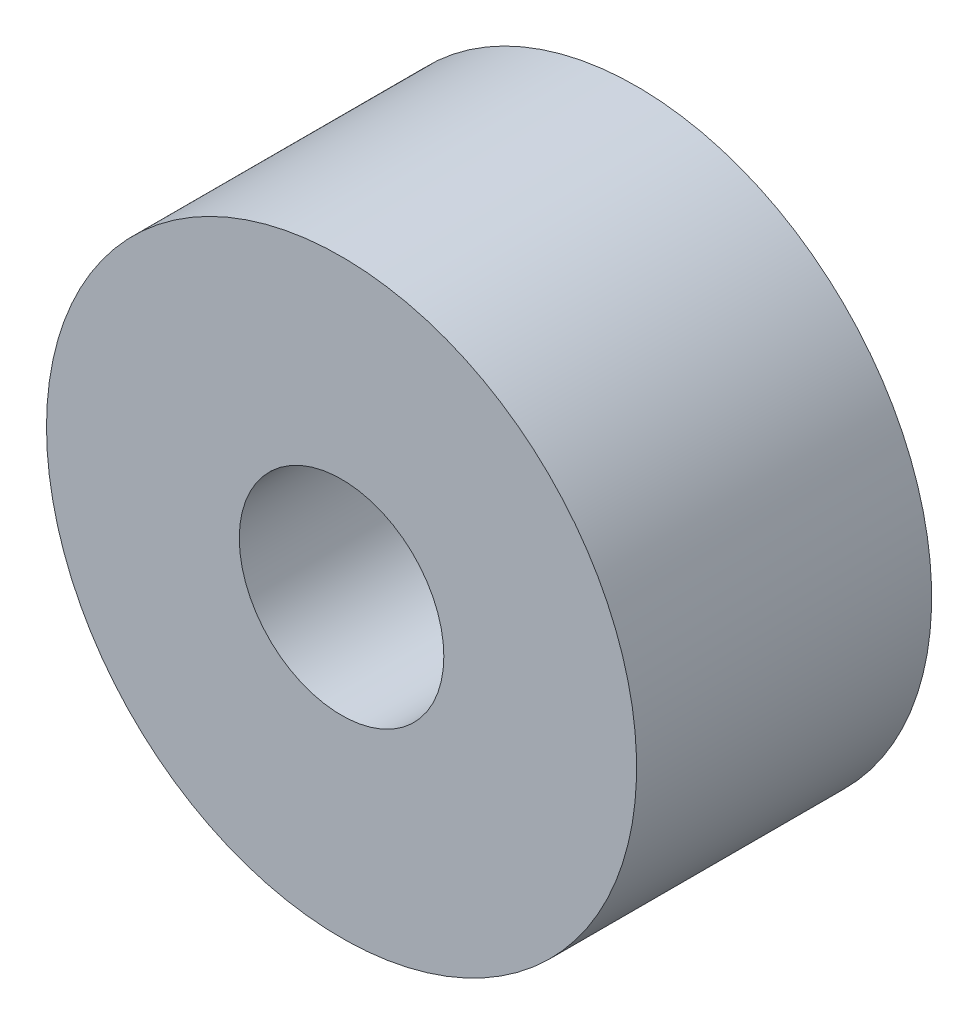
ISO-10303-21;
HEADER;
FILE_DESCRIPTION(('STEP AP214'),'2;1');
FILE_NAME('part.step','',(''),(''),'','','');
FILE_SCHEMA(('AUTOMOTIVE_DESIGN { 1 0 10303 214 1 1 1 1 }'));
ENDSEC;
DATA;
#1=APPLICATION_CONTEXT('core data for automotive mechanical design processes');
#2=APPLICATION_PROTOCOL_DEFINITION('international standard','automotive_design',2000,#1);
#3=PRODUCT_CONTEXT('',#1,'mechanical');
#4=PRODUCT('Part','Part','',(#3));
#5=PRODUCT_RELATED_PRODUCT_CATEGORY('part','',(#4));
#6=PRODUCT_DEFINITION_FORMATION('','',#4);
#7=PRODUCT_DEFINITION_CONTEXT('part definition',#1,'design');
#8=PRODUCT_DEFINITION('design','',#6,#7);
#9=PRODUCT_DEFINITION_SHAPE('','',#8);
#10=(LENGTH_UNIT() NAMED_UNIT(*) SI_UNIT(.MILLI.,.METRE.));
#11=(NAMED_UNIT(*) PLANE_ANGLE_UNIT() SI_UNIT($,.RADIAN.));
#12=(NAMED_UNIT(*) SI_UNIT($,.STERADIAN.) SOLID_ANGLE_UNIT());
#13=UNCERTAINTY_MEASURE_WITH_UNIT(LENGTH_MEASURE(1.E-05),#10,'distance_accuracy_value','');
#14=(GEOMETRIC_REPRESENTATION_CONTEXT(3) GLOBAL_UNCERTAINTY_ASSIGNED_CONTEXT((#13)) GLOBAL_UNIT_ASSIGNED_CONTEXT((#10,
#11,#12)) REPRESENTATION_CONTEXT('',''));
#15=CARTESIAN_POINT('',(0.,0.,0.));
#16=DIRECTION('',(0.,0.,1.));
#17=DIRECTION('',(1.,0.,0.));
#18=AXIS2_PLACEMENT_3D('',#15,#16,#17);
#19=CARTESIAN_POINT('',(0.,0.,9.525));
#20=DIRECTION('',(0.,0.,1.));
#21=DIRECTION('',(1.,0.,0.));
#22=AXIS2_PLACEMENT_3D('',#19,#20,#21);
#23=PLANE('',#22);
#24=CARTESIAN_POINT('',(0.,0.,9.525));
#25=DIRECTION('',(0.,0.,1.));
#26=DIRECTION('',(1.,0.,0.));
#27=AXIS2_PLACEMENT_3D('',#24,#25,#26);
#28=CIRCLE('',#27,9.525);
#29=CARTESIAN_POINT('',(-9.525,0.,9.525));
#30=VERTEX_POINT('',#29);
#31=EDGE_CURVE('E10',#30,#30,#28,.T.);
#32=ORIENTED_EDGE('',*,*,#31,.T.);
#33=EDGE_LOOP('',(#32));
#34=FACE_BOUND('',#33,.T.);
#35=CARTESIAN_POINT('',(0.,0.,9.525));
#36=DIRECTION('',(0.,0.,1.));
#37=DIRECTION('',(1.,0.,0.));
#38=AXIS2_PLACEMENT_3D('',#35,#36,#37);
#39=CIRCLE('',#38,3.302);
#40=CARTESIAN_POINT('',(-3.302,0.,9.525));
#41=VERTEX_POINT('',#40);
#42=EDGE_CURVE('E40',#41,#41,#39,.T.);
#43=ORIENTED_EDGE('',*,*,#42,.F.);
#44=EDGE_LOOP('',(#43));
#45=FACE_BOUND('',#44,.T.);
#46=ADVANCED_FACE('F29',(#34,#45),#23,.T.);
#47=CARTESIAN_POINT('',(0.,0.,0.));
#48=DIRECTION('',(0.,0.,1.));
#49=DIRECTION('',(1.,0.,0.));
#50=AXIS2_PLACEMENT_3D('',#47,#48,#49);
#51=PLANE('',#50);
#52=CARTESIAN_POINT('',(0.,0.,0.));
#53=DIRECTION('',(0.,0.,1.));
#54=DIRECTION('',(1.,0.,0.));
#55=AXIS2_PLACEMENT_3D('',#52,#53,#54);
#56=CIRCLE('',#55,9.525);
#57=CARTESIAN_POINT('',(-9.525,0.,0.));
#58=VERTEX_POINT('',#57);
#59=EDGE_CURVE('E36',#58,#58,#56,.T.);
#60=ORIENTED_EDGE('',*,*,#59,.F.);
#61=EDGE_LOOP('',(#60));
#62=FACE_BOUND('',#61,.T.);
#63=CARTESIAN_POINT('',(0.,0.,0.));
#64=DIRECTION('',(0.,0.,1.));
#65=DIRECTION('',(1.,0.,0.));
#66=AXIS2_PLACEMENT_3D('',#63,#64,#65);
#67=CIRCLE('',#66,3.302);
#68=CARTESIAN_POINT('',(-3.302,0.,0.));
#69=VERTEX_POINT('',#68);
#70=EDGE_CURVE('E44',#69,#69,#67,.T.);
#71=ORIENTED_EDGE('',*,*,#70,.T.);
#72=EDGE_LOOP('',(#71));
#73=FACE_BOUND('',#72,.T.);
#74=ADVANCED_FACE('F50',(#62,#73),#51,.F.);
#75=CARTESIAN_POINT('',(0.,0.,9.525));
#76=DIRECTION('',(0.,0.,-1.));
#77=DIRECTION('',(-1.,0.,0.));
#78=AXIS2_PLACEMENT_3D('',#75,#76,#77);
#79=CYLINDRICAL_SURFACE('',#78,9.525);
#80=CARTESIAN_POINT('',(-9.525,0.,9.525));
#81=CARTESIAN_POINT('',(-9.525,0.,9.42578125));
#82=CARTESIAN_POINT('',(-9.525,0.,9.3265625));
#83=CARTESIAN_POINT('',(-9.525,0.,9.128125));
#84=CARTESIAN_POINT('',(-9.525,0.,9.02890625));
#85=CARTESIAN_POINT('',(-9.525,0.,8.83046875));
#86=CARTESIAN_POINT('',(-9.525,0.,8.73125));
#87=CARTESIAN_POINT('',(-9.525,0.,8.5328125));
#88=CARTESIAN_POINT('',(-9.525,0.,8.43359375));
#89=CARTESIAN_POINT('',(-9.525,0.,8.23515625));
#90=CARTESIAN_POINT('',(-9.525,0.,8.1359375));
#91=CARTESIAN_POINT('',(-9.525,0.,7.9375));
#92=CARTESIAN_POINT('',(-9.525,0.,7.83828125));
#93=CARTESIAN_POINT('',(-9.525,0.,7.63984375));
#94=CARTESIAN_POINT('',(-9.525,0.,7.540625));
#95=CARTESIAN_POINT('',(-9.525,0.,7.3421875));
#96=CARTESIAN_POINT('',(-9.525,0.,7.24296875));
#97=CARTESIAN_POINT('',(-9.525,0.,7.04453125));
#98=CARTESIAN_POINT('',(-9.525,0.,6.9453125));
#99=CARTESIAN_POINT('',(-9.525,0.,6.746875));
#100=CARTESIAN_POINT('',(-9.525,0.,6.64765625));
#101=CARTESIAN_POINT('',(-9.525,0.,6.44921875));
#102=CARTESIAN_POINT('',(-9.525,0.,6.35));
#103=CARTESIAN_POINT('',(-9.525,0.,6.1515625));
#104=CARTESIAN_POINT('',(-9.525,0.,6.05234375));
#105=CARTESIAN_POINT('',(-9.525,0.,5.85390625));
#106=CARTESIAN_POINT('',(-9.525,0.,5.7546875));
#107=CARTESIAN_POINT('',(-9.525,0.,5.55625));
#108=CARTESIAN_POINT('',(-9.525,0.,5.45703125));
#109=CARTESIAN_POINT('',(-9.525,0.,5.25859375));
#110=CARTESIAN_POINT('',(-9.525,0.,5.159375));
#111=CARTESIAN_POINT('',(-9.525,0.,4.9609375));
#112=CARTESIAN_POINT('',(-9.525,0.,4.86171875));
#113=CARTESIAN_POINT('',(-9.525,0.,4.66328125));
#114=CARTESIAN_POINT('',(-9.525,0.,4.5640625));
#115=CARTESIAN_POINT('',(-9.525,0.,4.365625));
#116=CARTESIAN_POINT('',(-9.525,0.,4.26640625));
#117=CARTESIAN_POINT('',(-9.525,0.,4.06796875));
#118=CARTESIAN_POINT('',(-9.525,0.,3.96875));
#119=CARTESIAN_POINT('',(-9.525,0.,3.7703125));
#120=CARTESIAN_POINT('',(-9.525,0.,3.67109375));
#121=CARTESIAN_POINT('',(-9.525,0.,3.47265625));
#122=CARTESIAN_POINT('',(-9.525,0.,3.3734375));
#123=CARTESIAN_POINT('',(-9.525,0.,3.175));
#124=CARTESIAN_POINT('',(-9.525,0.,3.07578125));
#125=CARTESIAN_POINT('',(-9.525,0.,2.87734375));
#126=CARTESIAN_POINT('',(-9.525,0.,2.778125));
#127=CARTESIAN_POINT('',(-9.525,0.,2.5796875));
#128=CARTESIAN_POINT('',(-9.525,0.,2.48046875));
#129=CARTESIAN_POINT('',(-9.525,0.,2.28203125));
#130=CARTESIAN_POINT('',(-9.525,0.,2.1828125));
#131=CARTESIAN_POINT('',(-9.525,0.,1.984375));
#132=CARTESIAN_POINT('',(-9.525,0.,1.88515625));
#133=CARTESIAN_POINT('',(-9.525,0.,1.68671875));
#134=CARTESIAN_POINT('',(-9.525,0.,1.5875));
#135=CARTESIAN_POINT('',(-9.525,0.,1.3890625));
#136=CARTESIAN_POINT('',(-9.525,0.,1.28984375));
#137=CARTESIAN_POINT('',(-9.525,0.,1.09140625));
#138=CARTESIAN_POINT('',(-9.525,0.,0.992187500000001));
#139=CARTESIAN_POINT('',(-9.525,0.,0.793750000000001));
#140=CARTESIAN_POINT('',(-9.525,0.,0.69453125));
#141=CARTESIAN_POINT('',(-9.525,0.,0.49609375));
#142=CARTESIAN_POINT('',(-9.525,0.,0.396875));
#143=CARTESIAN_POINT('',(-9.525,0.,0.1984375));
#144=CARTESIAN_POINT('',(-9.525,0.,0.0992187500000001));
#145=CARTESIAN_POINT('',(-9.525,0.,0.));
#146=B_SPLINE_CURVE_WITH_KNOTS('',3,(#80,#81,#82,#83,#84,#85,#86,#87,#88,#89,#90,#91,#92,#93,
#94,#95,#96,#97,#98,#99,#100,#101,#102,#103,#104,#105,#106,#107,#108,#109,#110,#111,#112,#113,
#114,#115,#116,#117,#118,#119,#120,#121,#122,#123,#124,#125,#126,#127,#128,#129,#130,#131,#132,
#133,#134,#135,#136,#137,#138,#139,#140,#141,#142,#143,#144,#145),.UNSPECIFIED.,.F.,.F.,(4,2,2,
2,2,2,2,2,2,2,2,2,2,2,2,2,2,2,2,2,2,2,2,2,2,2,2,2,2,2,2,2,4),(0.,0.29765625,0.5953125,
0.892968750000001,1.190625,1.48828125,1.7859375,2.08359375,2.38125,2.67890625,2.9765625,
3.27421875,3.571875,3.86953125,4.1671875,4.46484375,4.7625,5.06015625,5.3578125,5.65546875,
5.953125,6.25078125,6.5484375,6.84609375,7.14375,7.44140625,7.7390625,8.03671875,8.334375,
8.63203125,8.9296875,9.22734375,9.525),.UNSPECIFIED.);
#147=EDGE_CURVE('BSEAM31',#30,#58,#146,.T.);
#148=ORIENTED_EDGE('',*,*,#31,.F.);
#149=ORIENTED_EDGE('',*,*,#59,.T.);
#150=ORIENTED_EDGE('',*,*,#147,.T.);
#151=ORIENTED_EDGE('',*,*,#147,.F.);
#152=EDGE_LOOP('',(#148,#150,#149,#151));
#153=FACE_BOUND('',#152,.T.);
#154=ADVANCED_FACE('F31',(#153),#79,.T.);
#155=CARTESIAN_POINT('',(0.,0.,9.525));
#156=DIRECTION('',(0.,0.,-1.));
#157=DIRECTION('',(-1.,0.,0.));
#158=AXIS2_PLACEMENT_3D('',#155,#156,#157);
#159=CYLINDRICAL_SURFACE('',#158,3.302);
#160=CARTESIAN_POINT('',(-3.302,0.,9.525));
#161=CARTESIAN_POINT('',(-3.302,0.,9.42578125));
#162=CARTESIAN_POINT('',(-3.302,0.,9.3265625));
#163=CARTESIAN_POINT('',(-3.302,0.,9.128125));
#164=CARTESIAN_POINT('',(-3.302,0.,9.02890625));
#165=CARTESIAN_POINT('',(-3.302,0.,8.83046875));
#166=CARTESIAN_POINT('',(-3.302,0.,8.73125));
#167=CARTESIAN_POINT('',(-3.302,0.,8.5328125));
#168=CARTESIAN_POINT('',(-3.302,0.,8.43359375));
#169=CARTESIAN_POINT('',(-3.302,0.,8.23515625));
#170=CARTESIAN_POINT('',(-3.302,0.,8.1359375));
#171=CARTESIAN_POINT('',(-3.302,0.,7.9375));
#172=CARTESIAN_POINT('',(-3.302,0.,7.83828125));
#173=CARTESIAN_POINT('',(-3.302,0.,7.63984375));
#174=CARTESIAN_POINT('',(-3.302,0.,7.540625));
#175=CARTESIAN_POINT('',(-3.302,0.,7.3421875));
#176=CARTESIAN_POINT('',(-3.302,0.,7.24296875));
#177=CARTESIAN_POINT('',(-3.302,0.,7.04453125));
#178=CARTESIAN_POINT('',(-3.302,0.,6.9453125));
#179=CARTESIAN_POINT('',(-3.302,0.,6.746875));
#180=CARTESIAN_POINT('',(-3.302,0.,6.64765625));
#181=CARTESIAN_POINT('',(-3.302,0.,6.44921875));
#182=CARTESIAN_POINT('',(-3.302,0.,6.35));
#183=CARTESIAN_POINT('',(-3.302,0.,6.1515625));
#184=CARTESIAN_POINT('',(-3.302,0.,6.05234375));
#185=CARTESIAN_POINT('',(-3.302,0.,5.85390625));
#186=CARTESIAN_POINT('',(-3.302,0.,5.7546875));
#187=CARTESIAN_POINT('',(-3.302,0.,5.55625));
#188=CARTESIAN_POINT('',(-3.302,0.,5.45703125));
#189=CARTESIAN_POINT('',(-3.302,0.,5.25859375));
#190=CARTESIAN_POINT('',(-3.302,0.,5.159375));
#191=CARTESIAN_POINT('',(-3.302,0.,4.9609375));
#192=CARTESIAN_POINT('',(-3.302,0.,4.86171875));
#193=CARTESIAN_POINT('',(-3.302,0.,4.66328125));
#194=CARTESIAN_POINT('',(-3.302,0.,4.5640625));
#195=CARTESIAN_POINT('',(-3.302,0.,4.365625));
#196=CARTESIAN_POINT('',(-3.302,0.,4.26640625));
#197=CARTESIAN_POINT('',(-3.302,0.,4.06796875));
#198=CARTESIAN_POINT('',(-3.302,0.,3.96875));
#199=CARTESIAN_POINT('',(-3.302,0.,3.7703125));
#200=CARTESIAN_POINT('',(-3.302,0.,3.67109375));
#201=CARTESIAN_POINT('',(-3.302,0.,3.47265625));
#202=CARTESIAN_POINT('',(-3.302,0.,3.3734375));
#203=CARTESIAN_POINT('',(-3.302,0.,3.175));
#204=CARTESIAN_POINT('',(-3.302,0.,3.07578125));
#205=CARTESIAN_POINT('',(-3.302,0.,2.87734375));
#206=CARTESIAN_POINT('',(-3.302,0.,2.778125));
#207=CARTESIAN_POINT('',(-3.302,0.,2.5796875));
#208=CARTESIAN_POINT('',(-3.302,0.,2.48046875));
#209=CARTESIAN_POINT('',(-3.302,0.,2.28203125));
#210=CARTESIAN_POINT('',(-3.302,0.,2.1828125));
#211=CARTESIAN_POINT('',(-3.302,0.,1.984375));
#212=CARTESIAN_POINT('',(-3.302,0.,1.88515625));
#213=CARTESIAN_POINT('',(-3.302,0.,1.68671875));
#214=CARTESIAN_POINT('',(-3.302,0.,1.5875));
#215=CARTESIAN_POINT('',(-3.302,0.,1.3890625));
#216=CARTESIAN_POINT('',(-3.302,0.,1.28984375));
#217=CARTESIAN_POINT('',(-3.302,0.,1.09140625));
#218=CARTESIAN_POINT('',(-3.302,0.,0.992187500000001));
#219=CARTESIAN_POINT('',(-3.302,0.,0.793750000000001));
#220=CARTESIAN_POINT('',(-3.302,0.,0.69453125));
#221=CARTESIAN_POINT('',(-3.302,0.,0.49609375));
#222=CARTESIAN_POINT('',(-3.302,0.,0.396875));
#223=CARTESIAN_POINT('',(-3.302,0.,0.1984375));
#224=CARTESIAN_POINT('',(-3.302,0.,0.0992187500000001));
#225=CARTESIAN_POINT('',(-3.302,0.,0.));
#226=B_SPLINE_CURVE_WITH_KNOTS('',3,(#160,#161,#162,#163,#164,#165,#166,#167,#168,#169,#170,
#171,#172,#173,#174,#175,#176,#177,#178,#179,#180,#181,#182,#183,#184,#185,#186,#187,#188,#189,
#190,#191,#192,#193,#194,#195,#196,#197,#198,#199,#200,#201,#202,#203,#204,#205,#206,#207,#208,
#209,#210,#211,#212,#213,#214,#215,#216,#217,#218,#219,#220,#221,#222,#223,#224,#225),
.UNSPECIFIED.,.F.,.F.,(4,2,2,2,2,2,2,2,2,2,2,2,2,2,2,2,2,2,2,2,2,2,2,2,2,2,2,2,2,2,2,2,4),(0.,
0.297656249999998,0.595312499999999,0.892968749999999,1.190625,1.48828125,1.7859375,2.08359375,
2.38125,2.67890625,2.9765625,3.27421875,3.571875,3.86953125,4.1671875,4.46484375,4.7625,
5.06015625,5.3578125,5.65546875,5.953125,6.25078125,6.5484375,6.84609375,7.14375,7.44140625,
7.7390625,8.03671875,8.334375,8.63203125,8.9296875,9.22734375,9.525),.UNSPECIFIED.);
#227=EDGE_CURVE('BSEAM52',#41,#69,#226,.T.);
#228=ORIENTED_EDGE('',*,*,#42,.T.);
#229=ORIENTED_EDGE('',*,*,#70,.F.);
#230=ORIENTED_EDGE('',*,*,#227,.T.);
#231=ORIENTED_EDGE('',*,*,#227,.F.);
#232=EDGE_LOOP('',(#228,#230,#229,#231));
#233=FACE_BOUND('',#232,.T.);
#234=ADVANCED_FACE('F52',(#233),#159,.F.);
#235=CLOSED_SHELL('',(#46,#74,#154,#234));
#236=MANIFOLD_SOLID_BREP('B2',#235);
#237=ADVANCED_BREP_SHAPE_REPRESENTATION('',(#18,#236),#14);
#238=SHAPE_DEFINITION_REPRESENTATION(#9,#237);
ENDSEC;
END-ISO-10303-21;
